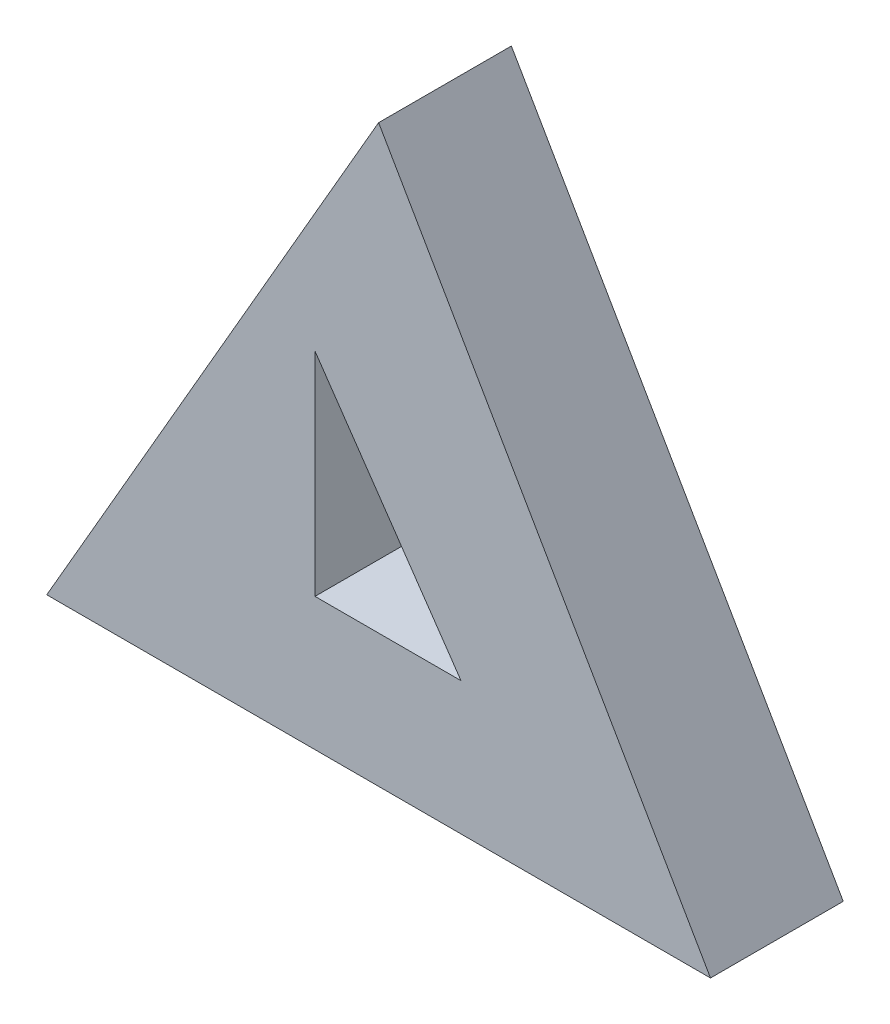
ISO-10303-21;
HEADER;
FILE_DESCRIPTION(('STEP AP214'),'2;1');
FILE_NAME('part.step','',(''),(''),'','','');
FILE_SCHEMA(('AUTOMOTIVE_DESIGN { 1 0 10303 214 1 1 1 1 }'));
ENDSEC;
DATA;
#1=APPLICATION_CONTEXT('core data for automotive mechanical design processes');
#2=APPLICATION_PROTOCOL_DEFINITION('international standard','automotive_design',2000,#1);
#3=PRODUCT_CONTEXT('',#1,'mechanical');
#4=PRODUCT('Part','Part','',(#3));
#5=PRODUCT_RELATED_PRODUCT_CATEGORY('part','',(#4));
#6=PRODUCT_DEFINITION_FORMATION('','',#4);
#7=PRODUCT_DEFINITION_CONTEXT('part definition',#1,'design');
#8=PRODUCT_DEFINITION('design','',#6,#7);
#9=PRODUCT_DEFINITION_SHAPE('','',#8);
#10=(LENGTH_UNIT() NAMED_UNIT(*) SI_UNIT(.MILLI.,.METRE.));
#11=(NAMED_UNIT(*) PLANE_ANGLE_UNIT() SI_UNIT($,.RADIAN.));
#12=(NAMED_UNIT(*) SI_UNIT($,.STERADIAN.) SOLID_ANGLE_UNIT());
#13=UNCERTAINTY_MEASURE_WITH_UNIT(LENGTH_MEASURE(1.E-05),#10,'distance_accuracy_value','');
#14=(GEOMETRIC_REPRESENTATION_CONTEXT(3) GLOBAL_UNCERTAINTY_ASSIGNED_CONTEXT((#13)) GLOBAL_UNIT_ASSIGNED_CONTEXT((#10,
#11,#12)) REPRESENTATION_CONTEXT('',''));
#15=CARTESIAN_POINT('',(0.,0.,0.));
#16=DIRECTION('',(0.,0.,1.));
#17=DIRECTION('',(1.,0.,0.));
#18=AXIS2_PLACEMENT_3D('',#15,#16,#17);
#19=CARTESIAN_POINT('',(50.,86.6025403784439,20.));
#20=DIRECTION('',(0.866025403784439,-0.5,0.));
#21=DIRECTION('',(0.5,0.866025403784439,0.));
#22=AXIS2_PLACEMENT_3D('',#19,#20,#21);
#23=PLANE('',#22);
#24=DIRECTION('',(-0.5,-0.866025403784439,0.));
#25=VECTOR('',#24,1.);
#26=CARTESIAN_POINT('',(50.,86.6025403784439,0.));
#27=LINE('',#26,#25);
#28=CARTESIAN_POINT('',(50.,86.6025403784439,0.));
#29=VERTEX_POINT('',#28);
#30=CARTESIAN_POINT('',(0.,0.,0.));
#31=VERTEX_POINT('',#30);
#32=EDGE_CURVE('E111',#29,#31,#27,.T.);
#33=ORIENTED_EDGE('',*,*,#32,.T.);
#34=DIRECTION('',(0.,0.,-1.));
#35=VECTOR('',#34,1.);
#36=CARTESIAN_POINT('',(0.,0.,20.));
#37=LINE('',#36,#35);
#38=CARTESIAN_POINT('',(0.,0.,20.));
#39=VERTEX_POINT('',#38);
#40=EDGE_CURVE('E11',#39,#31,#37,.T.);
#41=ORIENTED_EDGE('',*,*,#40,.F.);
#42=DIRECTION('',(-0.5,-0.866025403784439,0.));
#43=VECTOR('',#42,1.);
#44=CARTESIAN_POINT('',(50.,86.6025403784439,20.));
#45=LINE('',#44,#43);
#46=CARTESIAN_POINT('',(50.,86.6025403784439,20.));
#47=VERTEX_POINT('',#46);
#48=EDGE_CURVE('E113',#47,#39,#45,.T.);
#49=ORIENTED_EDGE('',*,*,#48,.F.);
#50=DIRECTION('',(0.,0.,-1.));
#51=VECTOR('',#50,1.);
#52=CARTESIAN_POINT('',(50.,86.6025403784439,20.));
#53=LINE('',#52,#51);
#54=EDGE_CURVE('E121',#47,#29,#53,.T.);
#55=ORIENTED_EDGE('',*,*,#54,.T.);
#56=EDGE_LOOP('',(#33,#41,#49,#55));
#57=FACE_BOUND('',#56,.T.);
#58=ADVANCED_FACE('F33',(#57),#23,.F.);
#59=CARTESIAN_POINT('',(0.,0.,20.));
#60=DIRECTION('',(0.,1.,0.));
#61=DIRECTION('',(0.,0.,1.));
#62=AXIS2_PLACEMENT_3D('',#59,#60,#61);
#63=PLANE('',#62);
#64=DIRECTION('',(1.,0.,0.));
#65=VECTOR('',#64,1.);
#66=CARTESIAN_POINT('',(0.,0.,0.));
#67=LINE('',#66,#65);
#68=CARTESIAN_POINT('',(100.,0.,0.));
#69=VERTEX_POINT('',#68);
#70=EDGE_CURVE('E124',#31,#69,#67,.T.);
#71=ORIENTED_EDGE('',*,*,#70,.T.);
#72=DIRECTION('',(0.,0.,-1.));
#73=VECTOR('',#72,1.);
#74=CARTESIAN_POINT('',(100.,0.,20.));
#75=LINE('',#74,#73);
#76=CARTESIAN_POINT('',(100.,0.,20.));
#77=VERTEX_POINT('',#76);
#78=EDGE_CURVE('E40',#77,#69,#75,.T.);
#79=ORIENTED_EDGE('',*,*,#78,.F.);
#80=DIRECTION('',(1.,0.,0.));
#81=VECTOR('',#80,1.);
#82=CARTESIAN_POINT('',(0.,0.,20.));
#83=LINE('',#82,#81);
#84=EDGE_CURVE('E116',#39,#77,#83,.T.);
#85=ORIENTED_EDGE('',*,*,#84,.F.);
#86=ORIENTED_EDGE('',*,*,#40,.T.);
#87=EDGE_LOOP('',(#71,#79,#85,#86));
#88=FACE_BOUND('',#87,.T.);
#89=ADVANCED_FACE('F142',(#88),#63,.F.);
#90=CARTESIAN_POINT('',(100.,0.,20.));
#91=DIRECTION('',(-0.866025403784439,-0.5,0.));
#92=DIRECTION('',(0.5,-0.866025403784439,0.));
#93=AXIS2_PLACEMENT_3D('',#90,#91,#92);
#94=PLANE('',#93);
#95=DIRECTION('',(-0.5,0.866025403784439,0.));
#96=VECTOR('',#95,1.);
#97=CARTESIAN_POINT('',(100.,0.,0.));
#98=LINE('',#97,#96);
#99=EDGE_CURVE('E117',#69,#29,#98,.T.);
#100=ORIENTED_EDGE('',*,*,#99,.T.);
#101=ORIENTED_EDGE('',*,*,#54,.F.);
#102=DIRECTION('',(-0.5,0.866025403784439,0.));
#103=VECTOR('',#102,1.);
#104=CARTESIAN_POINT('',(100.,0.,20.));
#105=LINE('',#104,#103);
#106=EDGE_CURVE('E119',#77,#47,#105,.T.);
#107=ORIENTED_EDGE('',*,*,#106,.F.);
#108=ORIENTED_EDGE('',*,*,#78,.T.);
#109=EDGE_LOOP('',(#100,#101,#107,#108));
#110=FACE_BOUND('',#109,.T.);
#111=ADVANCED_FACE('F133',(#110),#94,.F.);
#112=CARTESIAN_POINT('',(0.,0.,20.));
#113=DIRECTION('',(0.,0.,1.));
#114=DIRECTION('',(1.,0.,0.));
#115=AXIS2_PLACEMENT_3D('',#112,#113,#114);
#116=PLANE('',#115);
#117=DIRECTION('',(-0.566528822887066,0.824041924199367,0.));
#118=VECTOR('',#117,1.);
#119=CARTESIAN_POINT('',(62.4145188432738,20.,20.));
#120=LINE('',#119,#118);
#121=CARTESIAN_POINT('',(62.4145188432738,20.,20.));
#122=VERTEX_POINT('',#121);
#123=CARTESIAN_POINT('',(40.4145188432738,52.,20.));
#124=VERTEX_POINT('',#123);
#125=EDGE_CURVE('E47',#122,#124,#120,.T.);
#126=ORIENTED_EDGE('',*,*,#125,.F.);
#127=DIRECTION('',(1.,0.,0.));
#128=VECTOR('',#127,1.);
#129=CARTESIAN_POINT('',(40.4145188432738,20.,20.));
#130=LINE('',#129,#128);
#131=CARTESIAN_POINT('',(40.4145188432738,20.,20.));
#132=VERTEX_POINT('',#131);
#133=EDGE_CURVE('E100',#132,#122,#130,.T.);
#134=ORIENTED_EDGE('',*,*,#133,.F.);
#135=DIRECTION('',(0.,-1.,0.));
#136=VECTOR('',#135,1.);
#137=CARTESIAN_POINT('',(40.4145188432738,52.,20.));
#138=LINE('',#137,#136);
#139=EDGE_CURVE('E103',#124,#132,#138,.T.);
#140=ORIENTED_EDGE('',*,*,#139,.F.);
#141=EDGE_LOOP('',(#126,#134,#140));
#142=FACE_BOUND('',#141,.T.);
#143=ORIENTED_EDGE('',*,*,#48,.T.);
#144=ORIENTED_EDGE('',*,*,#84,.T.);
#145=ORIENTED_EDGE('',*,*,#106,.T.);
#146=EDGE_LOOP('',(#143,#144,#145));
#147=FACE_BOUND('',#146,.T.);
#148=ADVANCED_FACE('F141',(#142,#147),#116,.T.);
#149=CARTESIAN_POINT('',(0.,0.,0.));
#150=DIRECTION('',(0.,0.,1.));
#151=DIRECTION('',(1.,0.,0.));
#152=AXIS2_PLACEMENT_3D('',#149,#150,#151);
#153=PLANE('',#152);
#154=DIRECTION('',(1.,0.,0.));
#155=VECTOR('',#154,1.);
#156=CARTESIAN_POINT('',(40.4145188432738,20.,0.));
#157=LINE('',#156,#155);
#158=CARTESIAN_POINT('',(40.4145188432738,20.,0.));
#159=VERTEX_POINT('',#158);
#160=CARTESIAN_POINT('',(62.4145188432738,20.,0.));
#161=VERTEX_POINT('',#160);
#162=EDGE_CURVE('E55',#159,#161,#157,.T.);
#163=ORIENTED_EDGE('',*,*,#162,.T.);
#164=DIRECTION('',(-0.566528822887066,0.824041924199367,0.));
#165=VECTOR('',#164,1.);
#166=CARTESIAN_POINT('',(62.4145188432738,20.,0.));
#167=LINE('',#166,#165);
#168=CARTESIAN_POINT('',(40.4145188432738,52.,0.));
#169=VERTEX_POINT('',#168);
#170=EDGE_CURVE('E87',#161,#169,#167,.T.);
#171=ORIENTED_EDGE('',*,*,#170,.T.);
#172=DIRECTION('',(0.,-1.,0.));
#173=VECTOR('',#172,1.);
#174=CARTESIAN_POINT('',(40.4145188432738,52.,0.));
#175=LINE('',#174,#173);
#176=EDGE_CURVE('E94',#169,#159,#175,.T.);
#177=ORIENTED_EDGE('',*,*,#176,.T.);
#178=EDGE_LOOP('',(#163,#171,#177));
#179=FACE_BOUND('',#178,.T.);
#180=ORIENTED_EDGE('',*,*,#32,.F.);
#181=ORIENTED_EDGE('',*,*,#99,.F.);
#182=ORIENTED_EDGE('',*,*,#70,.F.);
#183=EDGE_LOOP('',(#180,#181,#182));
#184=FACE_BOUND('',#183,.T.);
#185=ADVANCED_FACE('F98',(#179,#184),#153,.F.);
#186=CARTESIAN_POINT('',(62.4145188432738,20.,0.));
#187=DIRECTION('',(0.824041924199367,0.566528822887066,0.));
#188=DIRECTION('',(-0.566528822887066,0.824041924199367,0.));
#189=AXIS2_PLACEMENT_3D('',#186,#187,#188);
#190=PLANE('',#189);
#191=ORIENTED_EDGE('',*,*,#125,.T.);
#192=DIRECTION('',(0.,0.,1.));
#193=VECTOR('',#192,1.);
#194=CARTESIAN_POINT('',(40.4145188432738,52.,0.));
#195=LINE('',#194,#193);
#196=EDGE_CURVE('E83',#169,#124,#195,.T.);
#197=ORIENTED_EDGE('',*,*,#196,.F.);
#198=ORIENTED_EDGE('',*,*,#170,.F.);
#199=DIRECTION('',(0.,0.,1.));
#200=VECTOR('',#199,1.);
#201=CARTESIAN_POINT('',(62.4145188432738,20.,0.));
#202=LINE('',#201,#200);
#203=EDGE_CURVE('E109',#161,#122,#202,.T.);
#204=ORIENTED_EDGE('',*,*,#203,.T.);
#205=EDGE_LOOP('',(#191,#197,#198,#204));
#206=FACE_BOUND('',#205,.T.);
#207=ADVANCED_FACE('F85',(#206),#190,.F.);
#208=CARTESIAN_POINT('',(40.4145188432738,20.,0.));
#209=DIRECTION('',(0.,-1.,0.));
#210=DIRECTION('',(1.,0.,0.));
#211=AXIS2_PLACEMENT_3D('',#208,#209,#210);
#212=PLANE('',#211);
#213=ORIENTED_EDGE('',*,*,#133,.T.);
#214=ORIENTED_EDGE('',*,*,#203,.F.);
#215=ORIENTED_EDGE('',*,*,#162,.F.);
#216=DIRECTION('',(0.,0.,1.));
#217=VECTOR('',#216,1.);
#218=CARTESIAN_POINT('',(40.4145188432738,20.,0.));
#219=LINE('',#218,#217);
#220=EDGE_CURVE('E91',#159,#132,#219,.T.);
#221=ORIENTED_EDGE('',*,*,#220,.T.);
#222=EDGE_LOOP('',(#213,#214,#215,#221));
#223=FACE_BOUND('',#222,.T.);
#224=ADVANCED_FACE('F157',(#223),#212,.F.);
#225=CARTESIAN_POINT('',(40.4145188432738,52.,0.));
#226=DIRECTION('',(-1.,0.,0.));
#227=DIRECTION('',(0.,-1.,0.));
#228=AXIS2_PLACEMENT_3D('',#225,#226,#227);
#229=PLANE('',#228);
#230=ORIENTED_EDGE('',*,*,#139,.T.);
#231=ORIENTED_EDGE('',*,*,#220,.F.);
#232=ORIENTED_EDGE('',*,*,#176,.F.);
#233=ORIENTED_EDGE('',*,*,#196,.T.);
#234=EDGE_LOOP('',(#230,#231,#232,#233));
#235=FACE_BOUND('',#234,.T.);
#236=ADVANCED_FACE('F95',(#235),#229,.F.);
#237=CLOSED_SHELL('',(#58,#89,#111,#148,#185,#207,#224,#236));
#238=MANIFOLD_SOLID_BREP('B2',#237);
#239=ADVANCED_BREP_SHAPE_REPRESENTATION('',(#18,#238),#14);
#240=SHAPE_DEFINITION_REPRESENTATION(#9,#239);
ENDSEC;
END-ISO-10303-21;
